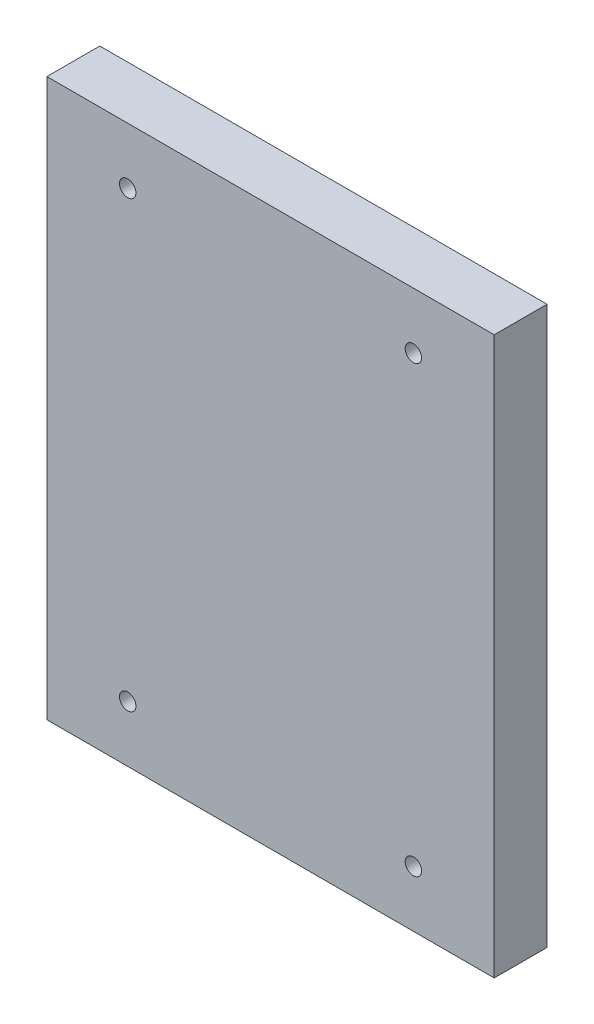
from build123d import *

# Parameters (mm, degrees)
SKETCH_1_W      = 84.548472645
SKETCH_1_H      = 105.291262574
SKETCH_1_R      = 1.55
EXTRUDE_1_DEPTH = 10


with BuildPart() as part:
    # Sketch 1 → Extrude 1 (new body)
    with BuildSketch(Plane.XY):
        with Locations((113.646889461, 44.26162207)):
            Rectangle(SKETCH_1_W, SKETCH_1_H)
        with Locations((86.64688946, 86.26162207)):
            Circle(SKETCH_1_R, mode=Mode.SUBTRACT)
        with Locations((140.64688946, 86.26162207)):
            Circle(SKETCH_1_R, mode=Mode.SUBTRACT)
        with Locations((140.64688946, 2.26162207)):
            Circle(SKETCH_1_R, mode=Mode.SUBTRACT)
        with Locations((86.64688946, 2.26162207)):
            Circle(SKETCH_1_R, mode=Mode.SUBTRACT)
    extrude(amount=EXTRUDE_1_DEPTH)


solid = part.part
